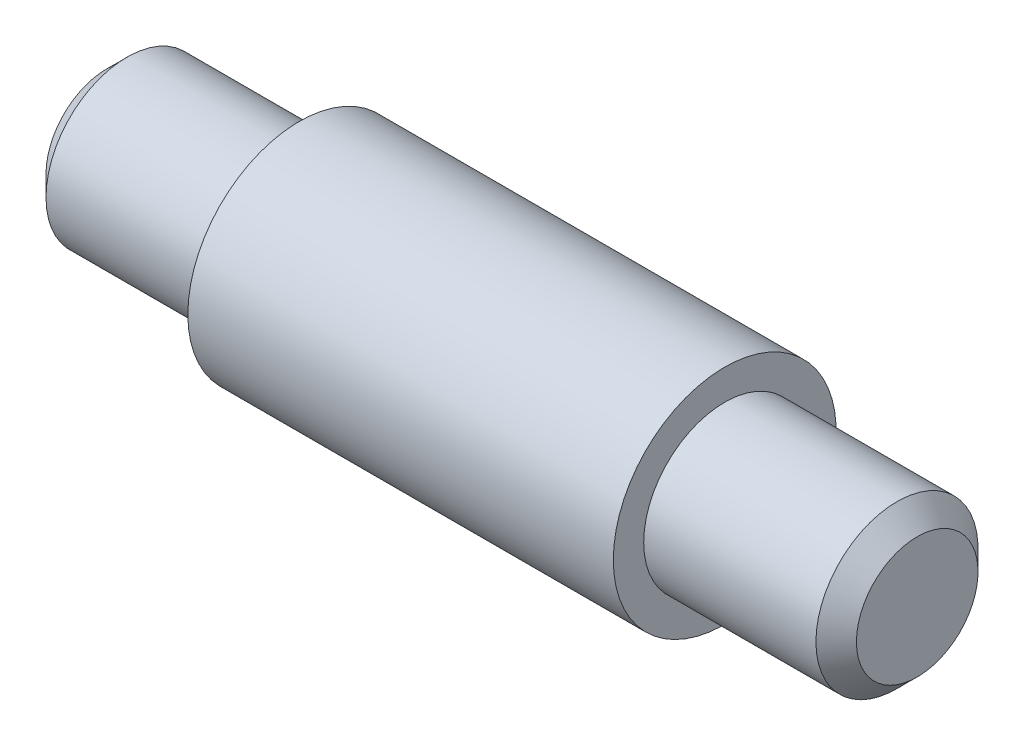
ISO-10303-21;
HEADER;
FILE_DESCRIPTION(('STEP AP214'),'2;1');
FILE_NAME('part.step','',(''),(''),'','','');
FILE_SCHEMA(('AUTOMOTIVE_DESIGN { 1 0 10303 214 1 1 1 1 }'));
ENDSEC;
DATA;
#1=APPLICATION_CONTEXT('core data for automotive mechanical design processes');
#2=APPLICATION_PROTOCOL_DEFINITION('international standard','automotive_design',2000,#1);
#3=PRODUCT_CONTEXT('',#1,'mechanical');
#4=PRODUCT('Part','Part','',(#3));
#5=PRODUCT_RELATED_PRODUCT_CATEGORY('part','',(#4));
#6=PRODUCT_DEFINITION_FORMATION('','',#4);
#7=PRODUCT_DEFINITION_CONTEXT('part definition',#1,'design');
#8=PRODUCT_DEFINITION('design','',#6,#7);
#9=PRODUCT_DEFINITION_SHAPE('','',#8);
#10=(LENGTH_UNIT() NAMED_UNIT(*) SI_UNIT(.MILLI.,.METRE.));
#11=(NAMED_UNIT(*) PLANE_ANGLE_UNIT() SI_UNIT($,.RADIAN.));
#12=(NAMED_UNIT(*) SI_UNIT($,.STERADIAN.) SOLID_ANGLE_UNIT());
#13=UNCERTAINTY_MEASURE_WITH_UNIT(LENGTH_MEASURE(1.E-05),#10,'distance_accuracy_value','');
#14=(GEOMETRIC_REPRESENTATION_CONTEXT(3) GLOBAL_UNCERTAINTY_ASSIGNED_CONTEXT((#13)) GLOBAL_UNIT_ASSIGNED_CONTEXT((#10,
#11,#12)) REPRESENTATION_CONTEXT('',''));
#15=CARTESIAN_POINT('',(0.,0.,0.));
#16=DIRECTION('',(0.,0.,1.));
#17=DIRECTION('',(1.,0.,0.));
#18=AXIS2_PLACEMENT_3D('',#15,#16,#17);
#19=CARTESIAN_POINT('',(0.,0.,0.));
#20=DIRECTION('',(-1.,0.,0.));
#21=DIRECTION('',(0.,0.,1.));
#22=AXIS2_PLACEMENT_3D('',#19,#20,#21);
#23=CYLINDRICAL_SURFACE('',#22,11.);
#24=CARTESIAN_POINT('',(21.,0.,0.));
#25=DIRECTION('',(-1.,0.,0.));
#26=DIRECTION('',(0.,0.,1.));
#27=AXIS2_PLACEMENT_3D('',#24,#25,#26);
#28=CIRCLE('',#27,11.);
#29=CARTESIAN_POINT('',(21.,0.,11.));
#30=VERTEX_POINT('',#29);
#31=EDGE_CURVE('E42',#30,#30,#28,.T.);
#32=ORIENTED_EDGE('',*,*,#31,.T.);
#33=EDGE_LOOP('',(#32));
#34=FACE_BOUND('',#33,.T.);
#35=CARTESIAN_POINT('',(-21.,0.,0.));
#36=DIRECTION('',(-1.,0.,0.));
#37=DIRECTION('',(0.,0.,1.));
#38=AXIS2_PLACEMENT_3D('',#35,#36,#37);
#39=CIRCLE('',#38,11.);
#40=CARTESIAN_POINT('',(-21.,0.,11.));
#41=VERTEX_POINT('',#40);
#42=EDGE_CURVE('E57',#41,#41,#39,.T.);
#43=ORIENTED_EDGE('',*,*,#42,.F.);
#44=EDGE_LOOP('',(#43));
#45=FACE_BOUND('',#44,.T.);
#46=ADVANCED_FACE('F32',(#34,#45),#23,.T.);
#47=CARTESIAN_POINT('',(21.,11.,0.));
#48=DIRECTION('',(-1.,0.,0.));
#49=DIRECTION('',(0.,0.,1.));
#50=AXIS2_PLACEMENT_3D('',#47,#48,#49);
#51=PLANE('',#50);
#52=ORIENTED_EDGE('',*,*,#31,.F.);
#53=EDGE_LOOP('',(#52));
#54=FACE_BOUND('',#53,.T.);
#55=CARTESIAN_POINT('',(21.,0.,0.));
#56=DIRECTION('',(-1.,0.,0.));
#57=DIRECTION('',(0.,0.,1.));
#58=AXIS2_PLACEMENT_3D('',#55,#56,#57);
#59=CIRCLE('',#58,8.);
#60=CARTESIAN_POINT('',(21.,0.,8.));
#61=VERTEX_POINT('',#60);
#62=EDGE_CURVE('E46',#61,#61,#59,.T.);
#63=ORIENTED_EDGE('',*,*,#62,.T.);
#64=EDGE_LOOP('',(#63));
#65=FACE_BOUND('',#64,.T.);
#66=ADVANCED_FACE('F82',(#54,#65),#51,.F.);
#67=CARTESIAN_POINT('',(0.,0.,0.));
#68=DIRECTION('',(-1.,0.,0.));
#69=DIRECTION('',(0.,0.,1.));
#70=AXIS2_PLACEMENT_3D('',#67,#68,#69);
#71=CYLINDRICAL_SURFACE('',#70,8.);
#72=CARTESIAN_POINT('',(38.,0.,0.));
#73=DIRECTION('',(-1.,0.,0.));
#74=DIRECTION('',(0.,0.,1.));
#75=AXIS2_PLACEMENT_3D('',#72,#73,#74);
#76=CIRCLE('',#75,8.);
#77=CARTESIAN_POINT('',(38.,0.,8.));
#78=VERTEX_POINT('',#77);
#79=EDGE_CURVE('E38',#78,#78,#76,.T.);
#80=ORIENTED_EDGE('',*,*,#79,.T.);
#81=EDGE_LOOP('',(#80));
#82=FACE_BOUND('',#81,.T.);
#83=ORIENTED_EDGE('',*,*,#62,.F.);
#84=EDGE_LOOP('',(#83));
#85=FACE_BOUND('',#84,.T.);
#86=ADVANCED_FACE('F87',(#82,#85),#71,.T.);
#87=CARTESIAN_POINT('',(40.,8.,0.));
#88=DIRECTION('',(-1.,0.,0.));
#89=DIRECTION('',(0.,0.,1.));
#90=AXIS2_PLACEMENT_3D('',#87,#88,#89);
#91=PLANE('',#90);
#92=CARTESIAN_POINT('',(40.,0.,0.));
#93=DIRECTION('',(-1.,0.,0.));
#94=DIRECTION('',(0.,0.,1.));
#95=AXIS2_PLACEMENT_3D('',#92,#93,#94);
#96=CIRCLE('',#95,5.99999999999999);
#97=CARTESIAN_POINT('',(40.,0.,5.99999999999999));
#98=VERTEX_POINT('',#97);
#99=EDGE_CURVE('E10',#98,#98,#96,.F.);
#100=ORIENTED_EDGE('',*,*,#99,.T.);
#101=EDGE_LOOP('',(#100));
#102=FACE_BOUND('',#101,.T.);
#103=ADVANCED_FACE('F78',(#102),#91,.F.);
#104=CARTESIAN_POINT('',(38.,0.,0.));
#105=DIRECTION('',(-1.,0.,0.));
#106=DIRECTION('',(0.,0.,1.));
#107=AXIS2_PLACEMENT_3D('',#104,#105,#106);
#108=CONICAL_SURFACE('',#107,8.,0.78539816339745);
#109=ORIENTED_EDGE('',*,*,#99,.F.);
#110=EDGE_LOOP('',(#109));
#111=FACE_BOUND('',#110,.T.);
#112=ORIENTED_EDGE('',*,*,#79,.F.);
#113=EDGE_LOOP('',(#112));
#114=FACE_BOUND('',#113,.T.);
#115=ADVANCED_FACE('F68',(#111,#114),#108,.T.);
#116=CARTESIAN_POINT('',(-21.,11.,0.));
#117=DIRECTION('',(1.,0.,0.));
#118=DIRECTION('',(0.,0.,1.));
#119=AXIS2_PLACEMENT_3D('',#116,#117,#118);
#120=PLANE('',#119);
#121=ORIENTED_EDGE('',*,*,#42,.T.);
#122=EDGE_LOOP('',(#121));
#123=FACE_BOUND('',#122,.T.);
#124=CARTESIAN_POINT('',(-21.,0.,0.));
#125=DIRECTION('',(-1.,0.,0.));
#126=DIRECTION('',(0.,0.,1.));
#127=AXIS2_PLACEMENT_3D('',#124,#125,#126);
#128=CIRCLE('',#127,8.);
#129=CARTESIAN_POINT('',(-21.,0.,8.));
#130=VERTEX_POINT('',#129);
#131=EDGE_CURVE('E60',#130,#130,#128,.T.);
#132=ORIENTED_EDGE('',*,*,#131,.F.);
#133=EDGE_LOOP('',(#132));
#134=FACE_BOUND('',#133,.T.);
#135=ADVANCED_FACE('F66',(#123,#134),#120,.F.);
#136=CARTESIAN_POINT('',(0.,0.,0.));
#137=DIRECTION('',(1.,0.,0.));
#138=DIRECTION('',(0.,0.,1.));
#139=AXIS2_PLACEMENT_3D('',#136,#137,#138);
#140=CYLINDRICAL_SURFACE('',#139,8.);
#141=CARTESIAN_POINT('',(-38.,0.,0.));
#142=DIRECTION('',(-1.,0.,0.));
#143=DIRECTION('',(0.,0.,1.));
#144=AXIS2_PLACEMENT_3D('',#141,#142,#143);
#145=CIRCLE('',#144,8.);
#146=CARTESIAN_POINT('',(-38.,0.,8.));
#147=VERTEX_POINT('',#146);
#148=EDGE_CURVE('E54',#147,#147,#145,.T.);
#149=ORIENTED_EDGE('',*,*,#148,.F.);
#150=EDGE_LOOP('',(#149));
#151=FACE_BOUND('',#150,.T.);
#152=ORIENTED_EDGE('',*,*,#131,.T.);
#153=EDGE_LOOP('',(#152));
#154=FACE_BOUND('',#153,.T.);
#155=ADVANCED_FACE('F64',(#151,#154),#140,.T.);
#156=CARTESIAN_POINT('',(-40.,8.,0.));
#157=DIRECTION('',(1.,0.,0.));
#158=DIRECTION('',(0.,0.,1.));
#159=AXIS2_PLACEMENT_3D('',#156,#157,#158);
#160=PLANE('',#159);
#161=CARTESIAN_POINT('',(-40.,0.,0.));
#162=DIRECTION('',(-1.,0.,0.));
#163=DIRECTION('',(0.,0.,1.));
#164=AXIS2_PLACEMENT_3D('',#161,#162,#163);
#165=CIRCLE('',#164,5.99999999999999);
#166=CARTESIAN_POINT('',(-40.,0.,5.99999999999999));
#167=VERTEX_POINT('',#166);
#168=EDGE_CURVE('E51',#167,#167,#165,.F.);
#169=ORIENTED_EDGE('',*,*,#168,.F.);
#170=EDGE_LOOP('',(#169));
#171=FACE_BOUND('',#170,.T.);
#172=ADVANCED_FACE('F75',(#171),#160,.F.);
#173=CARTESIAN_POINT('',(-38.,0.,0.));
#174=DIRECTION('',(1.,0.,0.));
#175=DIRECTION('',(0.,0.,1.));
#176=AXIS2_PLACEMENT_3D('',#173,#174,#175);
#177=CONICAL_SURFACE('',#176,8.,0.78539816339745);
#178=ORIENTED_EDGE('',*,*,#168,.T.);
#179=EDGE_LOOP('',(#178));
#180=FACE_BOUND('',#179,.T.);
#181=ORIENTED_EDGE('',*,*,#148,.T.);
#182=EDGE_LOOP('',(#181));
#183=FACE_BOUND('',#182,.T.);
#184=ADVANCED_FACE('F128',(#180,#183),#177,.T.);
#185=CLOSED_SHELL('',(#46,#66,#86,#103,#115,#135,#155,#172,#184));
#186=MANIFOLD_SOLID_BREP('B2',#185);
#187=ADVANCED_BREP_SHAPE_REPRESENTATION('',(#18,#186),#14);
#188=SHAPE_DEFINITION_REPRESENTATION(#9,#187);
ENDSEC;
END-ISO-10303-21;
